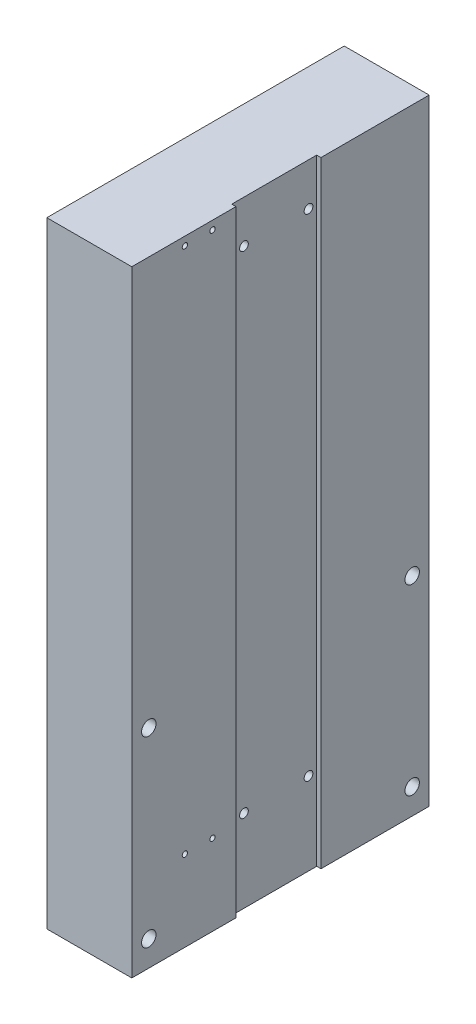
from build123d import *

# Parameters (mm, degrees)
ESQUISSE1_W                                        = 70
ESQUISSE1_H                                        = 145
BOSS_EXTRU_1_DEPTH                                 = 20
ESQUISSE9_W                                        = 1
ESQUISSE9_H                                        = 20
ENL_V_MAT_EXTRU_2_DEPTH                            = 151.499169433
ENL_V_MAT_EXTRU_1_DEPTH                            = 12
CHAMBRAGE_POUR_VIS_T_TE_HEXAGONALE_M31_D           = 3.4
CHAMBRAGE_POUR_VIS_T_TE_HEXAGONALE_M31_CBORE_D     = 6.5
CHAMBRAGE_POUR_VIS_T_TE_HEXAGONALE_M31_CBORE_DEPTH = 3.4
TROU_TARAUD_M2_51_D                                = 2.05
TROU_TARAUD_M1_61_D                                = 1.25
TROU_TARAUD_M1_61_DEPTH                            = 6
TROU_TARAUD_M1_61_TIP                              = 0.375537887


with BuildPart() as part:
    # Esquisse1 → Boss.-Extru.1 (new body)
    with BuildSketch(Plane(origin=(0, 0, 0), x_dir=(0, 0, -1), z_dir=(1, 0, 0))):
        with Locations((0, 72.5)):
            Rectangle(ESQUISSE1_W, ESQUISSE1_H)
    extrude(amount=-BOSS_EXTRU_1_DEPTH)

    # Esquisse9 → Enl_v. mat.-Extru.2 (cut, through all)
    with BuildSketch(Plane.XZ):
        with Locations((-0.5, 0.475)):
            Rectangle(ESQUISSE9_W, ESQUISSE9_H)
    extrude(amount=-ENL_V_MAT_EXTRU_2_DEPTH, mode=Mode.SUBTRACT)

    # Esquisse2 → Enl_v. mat.-Extru.1 (cut)
    with BuildSketch(Plane.ZY.offset(20)):
        with BuildLine():
            Line((27, 13), (27, 132))
            ThreePointArc((27, 132), (25.535533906, 135.535533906), (22, 137))
            Line((22, 137), (-22, 137))
            ThreePointArc((-22, 137), (-25.535533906, 135.535533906), (-27, 132))
            Line((-27, 132), (-27, 13))
            ThreePointArc((-27, 13), (-25.535533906, 9.464466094), (-22, 8))
            Line((-22, 8), (22, 8))
            ThreePointArc((22, 8), (25.535533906, 9.464466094), (27, 13))
        make_face()
    extrude(amount=-ENL_V_MAT_EXTRU_1_DEPTH, mode=Mode.SUBTRACT)

    # Chambrage pour vis _ t_te hexagonale M31 (through all)
    with Locations(Plane.ZY.offset(20)):
        with Locations((-31, 6), (-31, 49), (31, 49), (31, 6)):
            CounterBoreHole(CHAMBRAGE_POUR_VIS_T_TE_HEXAGONALE_M31_D / 2, CHAMBRAGE_POUR_VIS_T_TE_HEXAGONALE_M31_CBORE_D / 2, CHAMBRAGE_POUR_VIS_T_TE_HEXAGONALE_M31_CBORE_DEPTH)

    # Trou taraud_ M2.51 (through all)
    with Locations(Plane(origin=(-1, 38.35777486, -1.507252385), x_dir=(0, 0, -1), z_dir=(1, 0, 0))):
        with Locations((6.092747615, 96.64222514), (6.092747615, -18.95777486), (-9.107252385, -18.95777486), (-9.107252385, 96.64222514)):
            Hole(TROU_TARAUD_M2_51_D / 2)

    # Trou taraud_ M1.61
    with Locations(Plane(origin=(0, 0, 0), x_dir=(0, 0, -1), z_dir=(1, 0, 0))):
        with Locations((-16, 143), (-22.5, 143), (-16, 19), (-22.5, 19)):
            Hole(TROU_TARAUD_M1_61_D / 2, depth=TROU_TARAUD_M1_61_DEPTH)
            with Locations((0, 0, -(TROU_TARAUD_M1_61_DEPTH + TROU_TARAUD_M1_61_TIP / 2))):  # 118° drill point
                Cone(0, TROU_TARAUD_M1_61_D / 2, TROU_TARAUD_M1_61_TIP, mode=Mode.SUBTRACT)


solid = part.part
